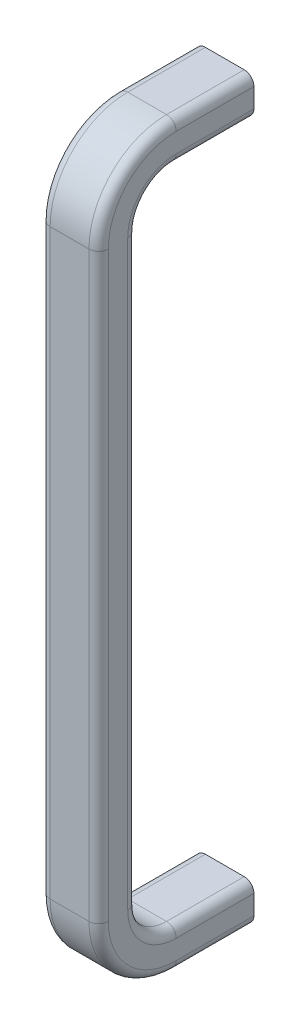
ISO-10303-21;
HEADER;
FILE_DESCRIPTION(('STEP AP214'),'2;1');
FILE_NAME('part.step','',(''),(''),'','','');
FILE_SCHEMA(('AUTOMOTIVE_DESIGN { 1 0 10303 214 1 1 1 1 }'));
ENDSEC;
DATA;
#1=APPLICATION_CONTEXT('core data for automotive mechanical design processes');
#2=APPLICATION_PROTOCOL_DEFINITION('international standard','automotive_design',2000,#1);
#3=PRODUCT_CONTEXT('',#1,'mechanical');
#4=PRODUCT('Part','Part','',(#3));
#5=PRODUCT_RELATED_PRODUCT_CATEGORY('part','',(#4));
#6=PRODUCT_DEFINITION_FORMATION('','',#4);
#7=PRODUCT_DEFINITION_CONTEXT('part definition',#1,'design');
#8=PRODUCT_DEFINITION('design','',#6,#7);
#9=PRODUCT_DEFINITION_SHAPE('','',#8);
#10=(LENGTH_UNIT() NAMED_UNIT(*) SI_UNIT(.MILLI.,.METRE.));
#11=(NAMED_UNIT(*) PLANE_ANGLE_UNIT() SI_UNIT($,.RADIAN.));
#12=(NAMED_UNIT(*) SI_UNIT($,.STERADIAN.) SOLID_ANGLE_UNIT());
#13=UNCERTAINTY_MEASURE_WITH_UNIT(LENGTH_MEASURE(1.E-05),#10,'distance_accuracy_value','');
#14=(GEOMETRIC_REPRESENTATION_CONTEXT(3) GLOBAL_UNCERTAINTY_ASSIGNED_CONTEXT((#13)) GLOBAL_UNIT_ASSIGNED_CONTEXT((#10,
#11,#12)) REPRESENTATION_CONTEXT('',''));
#15=CARTESIAN_POINT('',(0.,0.,0.));
#16=DIRECTION('',(0.,0.,1.));
#17=DIRECTION('',(1.,0.,0.));
#18=AXIS2_PLACEMENT_3D('',#15,#16,#17);
#19=CARTESIAN_POINT('',(0.,-90.,16.9999999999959));
#20=DIRECTION('',(0.,0.,-1.));
#21=DIRECTION('',(-1.,0.,0.));
#22=AXIS2_PLACEMENT_3D('',#19,#20,#21);
#23=CONICAL_SURFACE('',#22,2.0669999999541,1.02974425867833);
#24=CARTESIAN_POINT('',(-5.6843418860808E-11,-90.,18.2419788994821));
#25=VERTEX_POINT('',#24);
#26=VERTEX_LOOP('',#25);
#27=FACE_BOUND('',#26,.T.);
#28=CARTESIAN_POINT('',(0.,-90.,17.));
#29=DIRECTION('',(0.,0.,-1.));
#30=DIRECTION('',(0.,1.,0.));
#31=AXIS2_PLACEMENT_3D('',#28,#29,#30);
#32=CIRCLE('',#31,2.067);
#33=CARTESIAN_POINT('',(0.,-87.933,17.));
#34=VERTEX_POINT('',#33);
#35=EDGE_CURVE('E392',#34,#34,#32,.T.);
#36=ORIENTED_EDGE('',*,*,#35,.T.);
#37=EDGE_LOOP('',(#36));
#38=FACE_BOUND('',#37,.T.);
#39=ADVANCED_FACE('F16',(#27,#38),#23,.F.);
#40=CARTESIAN_POINT('',(0.,90.,16.9999999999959));
#41=DIRECTION('',(0.,0.,-1.));
#42=DIRECTION('',(-1.,0.,0.));
#43=AXIS2_PLACEMENT_3D('',#40,#41,#42);
#44=CONICAL_SURFACE('',#43,2.06699999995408,1.02974425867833);
#45=CARTESIAN_POINT('',(-5.6843418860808E-11,90.,18.2419788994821));
#46=VERTEX_POINT('',#45);
#47=VERTEX_LOOP('',#46);
#48=FACE_BOUND('',#47,.T.);
#49=CARTESIAN_POINT('',(0.,90.,17.0000000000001));
#50=DIRECTION('',(0.,0.,-1.));
#51=DIRECTION('',(0.,1.,0.));
#52=AXIS2_PLACEMENT_3D('',#49,#50,#51);
#53=CIRCLE('',#52,2.067);
#54=CARTESIAN_POINT('',(0.,92.067,17.0000000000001));
#55=VERTEX_POINT('',#54);
#56=EDGE_CURVE('E333',#55,#55,#53,.T.);
#57=ORIENTED_EDGE('',*,*,#56,.T.);
#58=EDGE_LOOP('',(#57));
#59=FACE_BOUND('',#58,.T.);
#60=ADVANCED_FACE('F988',(#48,#59),#44,.F.);
#61=CARTESIAN_POINT('',(0.,-90.,8.5));
#62=DIRECTION('',(0.,0.,-1.));
#63=DIRECTION('',(0.,1.,0.));
#64=AXIS2_PLACEMENT_3D('',#61,#62,#63);
#65=CYLINDRICAL_SURFACE('',#64,2.067);
#66=ORIENTED_EDGE('',*,*,#35,.F.);
#67=EDGE_LOOP('',(#66));
#68=FACE_BOUND('',#67,.T.);
#69=CARTESIAN_POINT('',(0.,-90.,0.));
#70=DIRECTION('',(0.,0.,-1.));
#71=DIRECTION('',(0.,1.,0.));
#72=AXIS2_PLACEMENT_3D('',#69,#70,#71);
#73=CIRCLE('',#72,2.067);
#74=CARTESIAN_POINT('',(0.,-87.933,0.));
#75=VERTEX_POINT('',#74);
#76=EDGE_CURVE('E449',#75,#75,#73,.F.);
#77=ORIENTED_EDGE('',*,*,#76,.F.);
#78=EDGE_LOOP('',(#77));
#79=FACE_BOUND('',#78,.T.);
#80=ADVANCED_FACE('F983',(#68,#79),#65,.F.);
#81=CARTESIAN_POINT('',(-7.5,-85.,20.));
#82=DIRECTION('',(0.,1.,0.));
#83=DIRECTION('',(-1.,0.,0.));
#84=AXIS2_PLACEMENT_3D('',#81,#82,#83);
#85=PLANE('',#84);
#86=DIRECTION('',(0.,0.,1.));
#87=VECTOR('',#86,1.);
#88=CARTESIAN_POINT('',(-4.99999999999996,-85.,10.));
#89=LINE('',#88,#87);
#90=CARTESIAN_POINT('',(-4.99999999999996,-85.,20.));
#91=VERTEX_POINT('',#90);
#92=CARTESIAN_POINT('',(-4.99999999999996,-85.,0.));
#93=VERTEX_POINT('',#92);
#94=EDGE_CURVE('E191',#91,#93,#89,.F.);
#95=ORIENTED_EDGE('',*,*,#94,.F.);
#96=DIRECTION('',(1.,0.,0.));
#97=VECTOR('',#96,1.);
#98=CARTESIAN_POINT('',(-7.50000000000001,-85.,20.));
#99=LINE('',#98,#97);
#100=CARTESIAN_POINT('',(5.,-85.,20.));
#101=VERTEX_POINT('',#100);
#102=EDGE_CURVE('E379',#91,#101,#99,.T.);
#103=ORIENTED_EDGE('',*,*,#102,.T.);
#104=DIRECTION('',(0.,0.,-1.));
#105=VECTOR('',#104,1.);
#106=CARTESIAN_POINT('',(5.,-85.,10.));
#107=LINE('',#106,#105);
#108=CARTESIAN_POINT('',(5.,-85.,0.));
#109=VERTEX_POINT('',#108);
#110=EDGE_CURVE('E395',#109,#101,#107,.F.);
#111=ORIENTED_EDGE('',*,*,#110,.F.);
#112=DIRECTION('',(1.,0.,0.));
#113=VECTOR('',#112,1.);
#114=CARTESIAN_POINT('',(0.,-85.,0.));
#115=LINE('',#114,#113);
#116=EDGE_CURVE('E452',#93,#109,#115,.T.);
#117=ORIENTED_EDGE('',*,*,#116,.F.);
#118=EDGE_LOOP('',(#95,#103,#111,#117));
#119=FACE_BOUND('',#118,.T.);
#120=ADVANCED_FACE('F911',(#119),#85,.T.);
#121=CARTESIAN_POINT('',(-7.50000000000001,-75.,20.));
#122=DIRECTION('',(1.,0.,0.));
#123=DIRECTION('',(0.,0.,-1.));
#124=AXIS2_PLACEMENT_3D('',#121,#122,#123);
#125=CYLINDRICAL_SURFACE('',#124,10.);
#126=ORIENTED_EDGE('',*,*,#102,.F.);
#127=CARTESIAN_POINT('',(-4.99999999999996,-75.,20.));
#128=DIRECTION('',(1.,0.,0.));
#129=DIRECTION('',(0.,0.,-1.));
#130=AXIS2_PLACEMENT_3D('',#127,#128,#129);
#131=CIRCLE('',#130,10.);
#132=CARTESIAN_POINT('',(-4.99999999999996,-75.,30.));
#133=VERTEX_POINT('',#132);
#134=EDGE_CURVE('E263',#133,#91,#131,.T.);
#135=ORIENTED_EDGE('',*,*,#134,.F.);
#136=DIRECTION('',(1.,0.,0.));
#137=VECTOR('',#136,1.);
#138=CARTESIAN_POINT('',(-7.5,-75.,30.));
#139=LINE('',#138,#137);
#140=CARTESIAN_POINT('',(5.,-75.,30.));
#141=VERTEX_POINT('',#140);
#142=EDGE_CURVE('E366',#141,#133,#139,.F.);
#143=ORIENTED_EDGE('',*,*,#142,.F.);
#144=CARTESIAN_POINT('',(5.,-75.,20.));
#145=DIRECTION('',(-1.,0.,0.));
#146=DIRECTION('',(0.,0.,1.));
#147=AXIS2_PLACEMENT_3D('',#144,#145,#146);
#148=CIRCLE('',#147,10.);
#149=EDGE_CURVE('E382',#101,#141,#148,.T.);
#150=ORIENTED_EDGE('',*,*,#149,.F.);
#151=EDGE_LOOP('',(#126,#135,#143,#150));
#152=FACE_BOUND('',#151,.T.);
#153=ADVANCED_FACE('F969',(#152),#125,.F.);
#154=CARTESIAN_POINT('',(-7.5,75.,30.));
#155=DIRECTION('',(0.,0.,-1.));
#156=DIRECTION('',(0.,1.,0.));
#157=AXIS2_PLACEMENT_3D('',#154,#155,#156);
#158=PLANE('',#157);
#159=DIRECTION('',(0.,-1.,0.));
#160=VECTOR('',#159,1.);
#161=CARTESIAN_POINT('',(-5.,85.,30.));
#162=LINE('',#161,#160);
#163=CARTESIAN_POINT('',(-5.,75.,30.));
#164=VERTEX_POINT('',#163);
#165=EDGE_CURVE('E293',#164,#133,#162,.T.);
#166=ORIENTED_EDGE('',*,*,#165,.F.);
#167=DIRECTION('',(1.,0.,0.));
#168=VECTOR('',#167,1.);
#169=CARTESIAN_POINT('',(0.,75.,30.));
#170=LINE('',#169,#168);
#171=CARTESIAN_POINT('',(5.,75.,30.));
#172=VERTEX_POINT('',#171);
#173=EDGE_CURVE('E357',#164,#172,#170,.T.);
#174=ORIENTED_EDGE('',*,*,#173,.T.);
#175=DIRECTION('',(0.,1.,0.));
#176=VECTOR('',#175,1.);
#177=CARTESIAN_POINT('',(5.,80.,30.));
#178=LINE('',#177,#176);
#179=EDGE_CURVE('E371',#141,#172,#178,.T.);
#180=ORIENTED_EDGE('',*,*,#179,.F.);
#181=ORIENTED_EDGE('',*,*,#142,.T.);
#182=EDGE_LOOP('',(#166,#174,#180,#181));
#183=FACE_BOUND('',#182,.T.);
#184=ADVANCED_FACE('F964',(#183),#158,.T.);
#185=CARTESIAN_POINT('',(0.,75.,20.));
#186=DIRECTION('',(1.,0.,0.));
#187=DIRECTION('',(0.,0.,-1.));
#188=AXIS2_PLACEMENT_3D('',#185,#186,#187);
#189=CYLINDRICAL_SURFACE('',#188,10.);
#190=ORIENTED_EDGE('',*,*,#173,.F.);
#191=CARTESIAN_POINT('',(-5.,75.,20.));
#192=DIRECTION('',(1.,0.,0.));
#193=DIRECTION('',(0.,0.,-1.));
#194=AXIS2_PLACEMENT_3D('',#191,#192,#193);
#195=CIRCLE('',#194,10.);
#196=CARTESIAN_POINT('',(-5.,85.,20.));
#197=VERTEX_POINT('',#196);
#198=EDGE_CURVE('E299',#197,#164,#195,.T.);
#199=ORIENTED_EDGE('',*,*,#198,.F.);
#200=DIRECTION('',(1.,0.,0.));
#201=VECTOR('',#200,1.);
#202=CARTESIAN_POINT('',(-7.5,85.,20.));
#203=LINE('',#202,#201);
#204=CARTESIAN_POINT('',(5.,85.,20.));
#205=VERTEX_POINT('',#204);
#206=EDGE_CURVE('E338',#205,#197,#203,.F.);
#207=ORIENTED_EDGE('',*,*,#206,.F.);
#208=CARTESIAN_POINT('',(5.,75.,20.));
#209=DIRECTION('',(-1.,0.,0.));
#210=DIRECTION('',(0.,0.,1.));
#211=AXIS2_PLACEMENT_3D('',#208,#209,#210);
#212=CIRCLE('',#211,10.);
#213=EDGE_CURVE('E356',#172,#205,#212,.T.);
#214=ORIENTED_EDGE('',*,*,#213,.F.);
#215=EDGE_LOOP('',(#190,#199,#207,#214));
#216=FACE_BOUND('',#215,.T.);
#217=ADVANCED_FACE('F956',(#216),#189,.F.);
#218=CARTESIAN_POINT('',(-7.5,85.,0.));
#219=DIRECTION('',(0.,-1.,0.));
#220=DIRECTION('',(1.,0.,0.));
#221=AXIS2_PLACEMENT_3D('',#218,#219,#220);
#222=PLANE('',#221);
#223=DIRECTION('',(0.,0.,1.));
#224=VECTOR('',#223,1.);
#225=CARTESIAN_POINT('',(-5.,85.,0.));
#226=LINE('',#225,#224);
#227=CARTESIAN_POINT('',(-5.,85.,0.));
#228=VERTEX_POINT('',#227);
#229=EDGE_CURVE('E326',#228,#197,#226,.T.);
#230=ORIENTED_EDGE('',*,*,#229,.F.);
#231=DIRECTION('',(1.,0.,0.));
#232=VECTOR('',#231,1.);
#233=CARTESIAN_POINT('',(0.,85.,0.));
#234=LINE('',#233,#232);
#235=CARTESIAN_POINT('',(5.,85.,0.));
#236=VERTEX_POINT('',#235);
#237=EDGE_CURVE('E442',#236,#228,#234,.F.);
#238=ORIENTED_EDGE('',*,*,#237,.F.);
#239=DIRECTION('',(0.,0.,-1.));
#240=VECTOR('',#239,1.);
#241=CARTESIAN_POINT('',(5.,85.,0.));
#242=LINE('',#241,#240);
#243=EDGE_CURVE('E346',#205,#236,#242,.T.);
#244=ORIENTED_EDGE('',*,*,#243,.F.);
#245=ORIENTED_EDGE('',*,*,#206,.T.);
#246=EDGE_LOOP('',(#230,#238,#244,#245));
#247=FACE_BOUND('',#246,.T.);
#248=ADVANCED_FACE('F947',(#247),#222,.T.);
#249=CARTESIAN_POINT('',(0.,90.,8.50000000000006));
#250=DIRECTION('',(0.,0.,-1.));
#251=DIRECTION('',(0.,1.,0.));
#252=AXIS2_PLACEMENT_3D('',#249,#250,#251);
#253=CYLINDRICAL_SURFACE('',#252,2.067);
#254=ORIENTED_EDGE('',*,*,#56,.F.);
#255=EDGE_LOOP('',(#254));
#256=FACE_BOUND('',#255,.T.);
#257=CARTESIAN_POINT('',(0.,90.,0.));
#258=DIRECTION('',(0.,0.,-1.));
#259=DIRECTION('',(0.,1.,0.));
#260=AXIS2_PLACEMENT_3D('',#257,#258,#259);
#261=CIRCLE('',#260,2.067);
#262=CARTESIAN_POINT('',(0.,92.067,0.));
#263=VERTEX_POINT('',#262);
#264=EDGE_CURVE('E427',#263,#263,#261,.F.);
#265=ORIENTED_EDGE('',*,*,#264,.F.);
#266=EDGE_LOOP('',(#265));
#267=FACE_BOUND('',#266,.T.);
#268=ADVANCED_FACE('F945',(#256,#267),#253,.F.);
#269=CARTESIAN_POINT('',(-5.,87.5,0.));
#270=DIRECTION('',(0.,0.,1.));
#271=DIRECTION('',(1.,0.,0.));
#272=AXIS2_PLACEMENT_3D('',#269,#270,#271);
#273=CYLINDRICAL_SURFACE('',#272,2.5);
#274=CARTESIAN_POINT('',(-5.,87.5,20.));
#275=DIRECTION('',(0.,0.,1.));
#276=DIRECTION('',(0.,1.,0.));
#277=AXIS2_PLACEMENT_3D('',#274,#275,#276);
#278=CIRCLE('',#277,2.5);
#279=CARTESIAN_POINT('',(-7.5,87.5,20.));
#280=VERTEX_POINT('',#279);
#281=EDGE_CURVE('E320',#280,#197,#278,.T.);
#282=ORIENTED_EDGE('',*,*,#281,.F.);
#283=DIRECTION('',(0.,0.,1.));
#284=VECTOR('',#283,1.);
#285=CARTESIAN_POINT('',(-7.5,87.5,0.));
#286=LINE('',#285,#284);
#287=CARTESIAN_POINT('',(-7.5,87.5,0.));
#288=VERTEX_POINT('',#287);
#289=EDGE_CURVE('E334',#288,#280,#286,.T.);
#290=ORIENTED_EDGE('',*,*,#289,.F.);
#291=CARTESIAN_POINT('',(-5.,87.5,0.));
#292=DIRECTION('',(0.,0.,1.));
#293=DIRECTION('',(1.,0.,0.));
#294=AXIS2_PLACEMENT_3D('',#291,#292,#293);
#295=CIRCLE('',#294,2.5);
#296=EDGE_CURVE('E437',#228,#288,#295,.F.);
#297=ORIENTED_EDGE('',*,*,#296,.F.);
#298=ORIENTED_EDGE('',*,*,#229,.T.);
#299=EDGE_LOOP('',(#282,#290,#297,#298));
#300=FACE_BOUND('',#299,.T.);
#301=ADVANCED_FACE('F313',(#300),#273,.T.);
#302=CARTESIAN_POINT('',(-5.,75.,20.));
#303=DIRECTION('',(1.,0.,0.));
#304=DIRECTION('',(0.,0.,-1.));
#305=AXIS2_PLACEMENT_3D('',#302,#303,#304);
#306=TOROIDAL_SURFACE('',#305,12.5,2.5);
#307=ORIENTED_EDGE('',*,*,#281,.T.);
#308=ORIENTED_EDGE('',*,*,#198,.T.);
#309=CARTESIAN_POINT('',(-5.,75.,32.5));
#310=DIRECTION('',(0.,-1.,0.));
#311=DIRECTION('',(1.,0.,0.));
#312=AXIS2_PLACEMENT_3D('',#309,#310,#311);
#313=CIRCLE('',#312,2.5);
#314=CARTESIAN_POINT('',(-7.5,75.,32.5));
#315=VERTEX_POINT('',#314);
#316=EDGE_CURVE('E296',#315,#164,#313,.T.);
#317=ORIENTED_EDGE('',*,*,#316,.F.);
#318=CARTESIAN_POINT('',(-7.5,75.,20.));
#319=DIRECTION('',(-1.,0.,0.));
#320=DIRECTION('',(0.,0.,1.));
#321=AXIS2_PLACEMENT_3D('',#318,#319,#320);
#322=CIRCLE('',#321,12.5);
#323=EDGE_CURVE('E648',#280,#315,#322,.F.);
#324=ORIENTED_EDGE('',*,*,#323,.F.);
#325=EDGE_LOOP('',(#307,#308,#317,#324));
#326=FACE_BOUND('',#325,.T.);
#327=ADVANCED_FACE('F307',(#326),#306,.T.);
#328=CARTESIAN_POINT('',(-5.,85.,32.5));
#329=DIRECTION('',(0.,-1.,0.));
#330=DIRECTION('',(1.,0.,0.));
#331=AXIS2_PLACEMENT_3D('',#328,#329,#330);
#332=CYLINDRICAL_SURFACE('',#331,2.5);
#333=ORIENTED_EDGE('',*,*,#316,.T.);
#334=ORIENTED_EDGE('',*,*,#165,.T.);
#335=CARTESIAN_POINT('',(-4.99999999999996,-75.,32.5));
#336=DIRECTION('',(0.,-1.,0.));
#337=DIRECTION('',(0.,0.,1.));
#338=AXIS2_PLACEMENT_3D('',#335,#336,#337);
#339=CIRCLE('',#338,2.5);
#340=CARTESIAN_POINT('',(-7.49999999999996,-75.,32.5));
#341=VERTEX_POINT('',#340);
#342=EDGE_CURVE('E283',#341,#133,#339,.T.);
#343=ORIENTED_EDGE('',*,*,#342,.F.);
#344=DIRECTION('',(0.,-1.,0.));
#345=VECTOR('',#344,1.);
#346=CARTESIAN_POINT('',(-7.5,95.,32.5));
#347=LINE('',#346,#345);
#348=EDGE_CURVE('E684',#315,#341,#347,.T.);
#349=ORIENTED_EDGE('',*,*,#348,.F.);
#350=EDGE_LOOP('',(#333,#334,#343,#349));
#351=FACE_BOUND('',#350,.T.);
#352=ADVANCED_FACE('F280',(#351),#332,.T.);
#353=CARTESIAN_POINT('',(-4.99999999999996,-75.,20.));
#354=DIRECTION('',(1.,0.,0.));
#355=DIRECTION('',(0.,0.,-1.));
#356=AXIS2_PLACEMENT_3D('',#353,#354,#355);
#357=TOROIDAL_SURFACE('',#356,12.5,2.5);
#358=ORIENTED_EDGE('',*,*,#134,.T.);
#359=CARTESIAN_POINT('',(-4.99999999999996,-87.5,20.));
#360=DIRECTION('',(0.,0.,1.));
#361=DIRECTION('',(1.,0.,0.));
#362=AXIS2_PLACEMENT_3D('',#359,#360,#361);
#363=CIRCLE('',#362,2.5);
#364=CARTESIAN_POINT('',(-7.49999999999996,-87.5,20.));
#365=VERTEX_POINT('',#364);
#366=EDGE_CURVE('E259',#365,#91,#363,.F.);
#367=ORIENTED_EDGE('',*,*,#366,.F.);
#368=CARTESIAN_POINT('',(-7.49999999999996,-75.,20.));
#369=DIRECTION('',(-1.,0.,0.));
#370=DIRECTION('',(0.,-1.,0.));
#371=AXIS2_PLACEMENT_3D('',#368,#369,#370);
#372=CIRCLE('',#371,12.5);
#373=EDGE_CURVE('E659',#341,#365,#372,.F.);
#374=ORIENTED_EDGE('',*,*,#373,.F.);
#375=ORIENTED_EDGE('',*,*,#342,.T.);
#376=EDGE_LOOP('',(#358,#367,#374,#375));
#377=FACE_BOUND('',#376,.T.);
#378=ADVANCED_FACE('F271',(#377),#357,.T.);
#379=CARTESIAN_POINT('',(-4.99999999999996,-87.5,10.));
#380=DIRECTION('',(0.,0.,1.));
#381=DIRECTION('',(1.,0.,0.));
#382=AXIS2_PLACEMENT_3D('',#379,#380,#381);
#383=CYLINDRICAL_SURFACE('',#382,2.5);
#384=ORIENTED_EDGE('',*,*,#366,.T.);
#385=ORIENTED_EDGE('',*,*,#94,.T.);
#386=CARTESIAN_POINT('',(-4.99999999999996,-87.5,0.));
#387=DIRECTION('',(0.,0.,1.));
#388=DIRECTION('',(1.,0.,0.));
#389=AXIS2_PLACEMENT_3D('',#386,#387,#388);
#390=CIRCLE('',#389,2.5);
#391=CARTESIAN_POINT('',(-7.49999999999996,-87.5,0.));
#392=VERTEX_POINT('',#391);
#393=EDGE_CURVE('E194',#392,#93,#390,.F.);
#394=ORIENTED_EDGE('',*,*,#393,.F.);
#395=DIRECTION('',(0.,0.,1.));
#396=VECTOR('',#395,1.);
#397=CARTESIAN_POINT('',(-7.49999999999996,-87.5,0.));
#398=LINE('',#397,#396);
#399=EDGE_CURVE('E256',#365,#392,#398,.F.);
#400=ORIENTED_EDGE('',*,*,#399,.F.);
#401=EDGE_LOOP('',(#384,#385,#394,#400));
#402=FACE_BOUND('',#401,.T.);
#403=ADVANCED_FACE('F277',(#402),#383,.T.);
#404=CARTESIAN_POINT('',(-4.99999999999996,-92.5,10.));
#405=DIRECTION('',(0.,0.,1.));
#406=DIRECTION('',(1.,0.,0.));
#407=AXIS2_PLACEMENT_3D('',#404,#405,#406);
#408=CYLINDRICAL_SURFACE('',#407,2.5);
#409=CARTESIAN_POINT('',(-5.,-92.5,20.));
#410=DIRECTION('',(0.,0.,-1.));
#411=DIRECTION('',(0.,-1.,0.));
#412=AXIS2_PLACEMENT_3D('',#409,#410,#411);
#413=CIRCLE('',#412,2.5);
#414=CARTESIAN_POINT('',(-7.49999999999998,-92.5,20.));
#415=VERTEX_POINT('',#414);
#416=CARTESIAN_POINT('',(-4.99999999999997,-95.,20.));
#417=VERTEX_POINT('',#416);
#418=EDGE_CURVE('E218',#415,#417,#413,.F.);
#419=ORIENTED_EDGE('',*,*,#418,.F.);
#420=DIRECTION('',(0.,0.,1.));
#421=VECTOR('',#420,1.);
#422=CARTESIAN_POINT('',(-7.49999999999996,-92.5,0.));
#423=LINE('',#422,#421);
#424=CARTESIAN_POINT('',(-7.49999999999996,-92.5,0.));
#425=VERTEX_POINT('',#424);
#426=EDGE_CURVE('E187',#425,#415,#423,.T.);
#427=ORIENTED_EDGE('',*,*,#426,.F.);
#428=CARTESIAN_POINT('',(-4.99999999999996,-92.5,0.));
#429=DIRECTION('',(0.,0.,1.));
#430=DIRECTION('',(1.,0.,0.));
#431=AXIS2_PLACEMENT_3D('',#428,#429,#430);
#432=CIRCLE('',#431,2.5);
#433=CARTESIAN_POINT('',(-4.99999999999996,-95.,0.));
#434=VERTEX_POINT('',#433);
#435=EDGE_CURVE('E19',#434,#425,#432,.F.);
#436=ORIENTED_EDGE('',*,*,#435,.F.);
#437=DIRECTION('',(0.,0.,-1.));
#438=VECTOR('',#437,1.);
#439=CARTESIAN_POINT('',(-4.99999999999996,-95.,20.));
#440=LINE('',#439,#438);
#441=EDGE_CURVE('E184',#417,#434,#440,.T.);
#442=ORIENTED_EDGE('',*,*,#441,.F.);
#443=EDGE_LOOP('',(#419,#427,#436,#442));
#444=FACE_BOUND('',#443,.T.);
#445=ADVANCED_FACE('F183',(#444),#408,.T.);
#446=CARTESIAN_POINT('',(5.,-92.5,10.));
#447=DIRECTION('',(0.,0.,-1.));
#448=DIRECTION('',(-1.,0.,0.));
#449=AXIS2_PLACEMENT_3D('',#446,#447,#448);
#450=CYLINDRICAL_SURFACE('',#449,2.5);
#451=CARTESIAN_POINT('',(5.,-92.5,20.));
#452=DIRECTION('',(0.,0.,1.));
#453=DIRECTION('',(0.,-1.,0.));
#454=AXIS2_PLACEMENT_3D('',#451,#452,#453);
#455=CIRCLE('',#454,2.5);
#456=CARTESIAN_POINT('',(5.,-95.,20.));
#457=VERTEX_POINT('',#456);
#458=CARTESIAN_POINT('',(7.5,-92.5,20.));
#459=VERTEX_POINT('',#458);
#460=EDGE_CURVE('E578',#457,#459,#455,.T.);
#461=ORIENTED_EDGE('',*,*,#460,.F.);
#462=DIRECTION('',(0.,0.,-1.));
#463=VECTOR('',#462,1.);
#464=CARTESIAN_POINT('',(5.,-95.,20.));
#465=LINE('',#464,#463);
#466=CARTESIAN_POINT('',(5.,-95.,0.));
#467=VERTEX_POINT('',#466);
#468=EDGE_CURVE('E204',#467,#457,#465,.F.);
#469=ORIENTED_EDGE('',*,*,#468,.F.);
#470=CARTESIAN_POINT('',(5.,-92.5,0.));
#471=DIRECTION('',(0.,0.,-1.));
#472=DIRECTION('',(-1.,0.,0.));
#473=AXIS2_PLACEMENT_3D('',#470,#471,#472);
#474=CIRCLE('',#473,2.5);
#475=CARTESIAN_POINT('',(7.5,-92.5,0.));
#476=VERTEX_POINT('',#475);
#477=EDGE_CURVE('E200',#476,#467,#474,.T.);
#478=ORIENTED_EDGE('',*,*,#477,.F.);
#479=DIRECTION('',(0.,0.,-1.));
#480=VECTOR('',#479,1.);
#481=CARTESIAN_POINT('',(7.5,-92.5,0.));
#482=LINE('',#481,#480);
#483=EDGE_CURVE('E466',#459,#476,#482,.T.);
#484=ORIENTED_EDGE('',*,*,#483,.F.);
#485=EDGE_LOOP('',(#461,#469,#478,#484));
#486=FACE_BOUND('',#485,.T.);
#487=ADVANCED_FACE('F920',(#486),#450,.T.);
#488=CARTESIAN_POINT('',(0.,-100.,0.));
#489=DIRECTION('',(0.,0.,-1.));
#490=DIRECTION('',(0.,1.,0.));
#491=AXIS2_PLACEMENT_3D('',#488,#489,#490);
#492=PLANE('',#491);
#493=ORIENTED_EDGE('',*,*,#76,.T.);
#494=EDGE_LOOP('',(#493));
#495=FACE_BOUND('',#494,.T.);
#496=ORIENTED_EDGE('',*,*,#477,.T.);
#497=DIRECTION('',(1.,0.,0.));
#498=VECTOR('',#497,1.);
#499=CARTESIAN_POINT('',(7.5,-95.,0.));
#500=LINE('',#499,#498);
#501=EDGE_CURVE('E198',#434,#467,#500,.T.);
#502=ORIENTED_EDGE('',*,*,#501,.F.);
#503=ORIENTED_EDGE('',*,*,#435,.T.);
#504=DIRECTION('',(0.,-1.,0.));
#505=VECTOR('',#504,1.);
#506=CARTESIAN_POINT('',(-7.5,95.,0.));
#507=LINE('',#506,#505);
#508=EDGE_CURVE('E253',#392,#425,#507,.T.);
#509=ORIENTED_EDGE('',*,*,#508,.F.);
#510=ORIENTED_EDGE('',*,*,#393,.T.);
#511=ORIENTED_EDGE('',*,*,#116,.T.);
#512=CARTESIAN_POINT('',(5.,-87.5,0.));
#513=DIRECTION('',(0.,0.,-1.));
#514=DIRECTION('',(-1.,0.,0.));
#515=AXIS2_PLACEMENT_3D('',#512,#513,#514);
#516=CIRCLE('',#515,2.5);
#517=CARTESIAN_POINT('',(7.5,-87.5,0.));
#518=VERTEX_POINT('',#517);
#519=EDGE_CURVE('E398',#518,#109,#516,.F.);
#520=ORIENTED_EDGE('',*,*,#519,.F.);
#521=DIRECTION('',(0.,1.,0.));
#522=VECTOR('',#521,1.);
#523=CARTESIAN_POINT('',(7.5,85.,0.));
#524=LINE('',#523,#522);
#525=EDGE_CURVE('E464',#476,#518,#524,.T.);
#526=ORIENTED_EDGE('',*,*,#525,.F.);
#527=EDGE_LOOP('',(#496,#502,#503,#509,#510,#511,#520,#526));
#528=FACE_BOUND('',#527,.T.);
#529=ADVANCED_FACE('F197',(#495,#528),#492,.T.);
#530=CARTESIAN_POINT('',(5.,-87.5,10.));
#531=DIRECTION('',(0.,0.,-1.));
#532=DIRECTION('',(-1.,0.,0.));
#533=AXIS2_PLACEMENT_3D('',#530,#531,#532);
#534=CYLINDRICAL_SURFACE('',#533,2.5);
#535=CARTESIAN_POINT('',(5.,-87.5,20.));
#536=DIRECTION('',(0.,0.,1.));
#537=DIRECTION('',(0.,-1.,0.));
#538=AXIS2_PLACEMENT_3D('',#535,#536,#537);
#539=CIRCLE('',#538,2.5);
#540=CARTESIAN_POINT('',(7.5,-87.5,20.));
#541=VERTEX_POINT('',#540);
#542=EDGE_CURVE('E390',#541,#101,#539,.T.);
#543=ORIENTED_EDGE('',*,*,#542,.F.);
#544=DIRECTION('',(0.,0.,-1.));
#545=VECTOR('',#544,1.);
#546=CARTESIAN_POINT('',(7.5,-87.5,0.));
#547=LINE('',#546,#545);
#548=EDGE_CURVE('E469',#518,#541,#547,.F.);
#549=ORIENTED_EDGE('',*,*,#548,.F.);
#550=ORIENTED_EDGE('',*,*,#519,.T.);
#551=ORIENTED_EDGE('',*,*,#110,.T.);
#552=EDGE_LOOP('',(#543,#549,#550,#551));
#553=FACE_BOUND('',#552,.T.);
#554=ADVANCED_FACE('F495',(#553),#534,.T.);
#555=CARTESIAN_POINT('',(5.,-75.,20.));
#556=DIRECTION('',(-1.,0.,0.));
#557=DIRECTION('',(0.,0.,1.));
#558=AXIS2_PLACEMENT_3D('',#555,#556,#557);
#559=TOROIDAL_SURFACE('',#558,12.5,2.5);
#560=ORIENTED_EDGE('',*,*,#149,.T.);
#561=CARTESIAN_POINT('',(5.,-75.,32.5));
#562=DIRECTION('',(0.,1.,0.));
#563=DIRECTION('',(0.,0.,1.));
#564=AXIS2_PLACEMENT_3D('',#561,#562,#563);
#565=CIRCLE('',#564,2.5);
#566=CARTESIAN_POINT('',(7.5,-75.,32.5));
#567=VERTEX_POINT('',#566);
#568=EDGE_CURVE('E374',#567,#141,#565,.T.);
#569=ORIENTED_EDGE('',*,*,#568,.F.);
#570=CARTESIAN_POINT('',(7.5,-75.,20.));
#571=DIRECTION('',(1.,0.,0.));
#572=DIRECTION('',(0.,0.,1.));
#573=AXIS2_PLACEMENT_3D('',#570,#571,#572);
#574=CIRCLE('',#573,12.5);
#575=EDGE_CURVE('E767',#541,#567,#574,.F.);
#576=ORIENTED_EDGE('',*,*,#575,.F.);
#577=ORIENTED_EDGE('',*,*,#542,.T.);
#578=EDGE_LOOP('',(#560,#569,#576,#577));
#579=FACE_BOUND('',#578,.T.);
#580=ADVANCED_FACE('F481',(#579),#559,.T.);
#581=CARTESIAN_POINT('',(5.,80.,32.5));
#582=DIRECTION('',(0.,1.,0.));
#583=DIRECTION('',(0.,0.,1.));
#584=AXIS2_PLACEMENT_3D('',#581,#582,#583);
#585=CYLINDRICAL_SURFACE('',#584,2.5);
#586=ORIENTED_EDGE('',*,*,#568,.T.);
#587=ORIENTED_EDGE('',*,*,#179,.T.);
#588=CARTESIAN_POINT('',(5.,75.,32.5));
#589=DIRECTION('',(0.,1.,0.));
#590=DIRECTION('',(0.,0.,1.));
#591=AXIS2_PLACEMENT_3D('',#588,#589,#590);
#592=CIRCLE('',#591,2.5);
#593=CARTESIAN_POINT('',(7.5,75.,32.5));
#594=VERTEX_POINT('',#593);
#595=EDGE_CURVE('E361',#594,#172,#592,.T.);
#596=ORIENTED_EDGE('',*,*,#595,.F.);
#597=DIRECTION('',(0.,1.,0.));
#598=VECTOR('',#597,1.);
#599=CARTESIAN_POINT('',(7.5,85.,32.5));
#600=LINE('',#599,#598);
#601=EDGE_CURVE('E817',#567,#594,#600,.T.);
#602=ORIENTED_EDGE('',*,*,#601,.F.);
#603=EDGE_LOOP('',(#586,#587,#596,#602));
#604=FACE_BOUND('',#603,.T.);
#605=ADVANCED_FACE('F491',(#604),#585,.T.);
#606=CARTESIAN_POINT('',(5.,75.,20.));
#607=DIRECTION('',(-1.,0.,0.));
#608=DIRECTION('',(0.,0.,1.));
#609=AXIS2_PLACEMENT_3D('',#606,#607,#608);
#610=TOROIDAL_SURFACE('',#609,12.5,2.5);
#611=ORIENTED_EDGE('',*,*,#595,.T.);
#612=ORIENTED_EDGE('',*,*,#213,.T.);
#613=CARTESIAN_POINT('',(5.,87.5,20.));
#614=DIRECTION('',(0.,0.,-1.));
#615=DIRECTION('',(-1.,0.,0.));
#616=AXIS2_PLACEMENT_3D('',#613,#614,#615);
#617=CIRCLE('',#616,2.5);
#618=CARTESIAN_POINT('',(7.5,87.5,20.));
#619=VERTEX_POINT('',#618);
#620=EDGE_CURVE('E351',#619,#205,#617,.T.);
#621=ORIENTED_EDGE('',*,*,#620,.F.);
#622=CARTESIAN_POINT('',(7.5,75.,20.));
#623=DIRECTION('',(1.,0.,0.));
#624=DIRECTION('',(0.,1.,0.));
#625=AXIS2_PLACEMENT_3D('',#622,#623,#624);
#626=CIRCLE('',#625,12.5);
#627=EDGE_CURVE('E780',#594,#619,#626,.F.);
#628=ORIENTED_EDGE('',*,*,#627,.F.);
#629=EDGE_LOOP('',(#611,#612,#621,#628));
#630=FACE_BOUND('',#629,.T.);
#631=ADVANCED_FACE('F513',(#630),#610,.T.);
#632=CARTESIAN_POINT('',(5.,87.5,0.));
#633=DIRECTION('',(0.,0.,-1.));
#634=DIRECTION('',(-1.,0.,0.));
#635=AXIS2_PLACEMENT_3D('',#632,#633,#634);
#636=CYLINDRICAL_SURFACE('',#635,2.5);
#637=ORIENTED_EDGE('',*,*,#620,.T.);
#638=ORIENTED_EDGE('',*,*,#243,.T.);
#639=CARTESIAN_POINT('',(5.,87.5,0.));
#640=DIRECTION('',(0.,0.,-1.));
#641=DIRECTION('',(-1.,0.,0.));
#642=AXIS2_PLACEMENT_3D('',#639,#640,#641);
#643=CIRCLE('',#642,2.5);
#644=CARTESIAN_POINT('',(7.5,87.5,0.));
#645=VERTEX_POINT('',#644);
#646=EDGE_CURVE('E349',#645,#236,#643,.T.);
#647=ORIENTED_EDGE('',*,*,#646,.F.);
#648=DIRECTION('',(0.,0.,-1.));
#649=VECTOR('',#648,1.);
#650=CARTESIAN_POINT('',(7.5,87.5,0.));
#651=LINE('',#650,#649);
#652=EDGE_CURVE('E540',#619,#645,#651,.T.);
#653=ORIENTED_EDGE('',*,*,#652,.F.);
#654=EDGE_LOOP('',(#637,#638,#647,#653));
#655=FACE_BOUND('',#654,.T.);
#656=ADVANCED_FACE('F525',(#655),#636,.T.);
#657=CARTESIAN_POINT('',(5.,92.5,0.));
#658=DIRECTION('',(0.,0.,1.));
#659=DIRECTION('',(1.,0.,0.));
#660=AXIS2_PLACEMENT_3D('',#657,#658,#659);
#661=CYLINDRICAL_SURFACE('',#660,2.5);
#662=CARTESIAN_POINT('',(5.,92.5,0.));
#663=DIRECTION('',(0.,0.,1.));
#664=DIRECTION('',(1.,0.,0.));
#665=AXIS2_PLACEMENT_3D('',#662,#663,#664);
#666=CIRCLE('',#665,2.5);
#667=CARTESIAN_POINT('',(5.,95.,0.));
#668=VERTEX_POINT('',#667);
#669=CARTESIAN_POINT('',(7.5,92.5,0.));
#670=VERTEX_POINT('',#669);
#671=EDGE_CURVE('E433',#668,#670,#666,.F.);
#672=ORIENTED_EDGE('',*,*,#671,.F.);
#673=DIRECTION('',(0.,0.,1.));
#674=VECTOR('',#673,1.);
#675=CARTESIAN_POINT('',(5.,95.,0.));
#676=LINE('',#675,#674);
#677=CARTESIAN_POINT('',(5.,95.,20.));
#678=VERTEX_POINT('',#677);
#679=EDGE_CURVE('E713',#678,#668,#676,.F.);
#680=ORIENTED_EDGE('',*,*,#679,.F.);
#681=CARTESIAN_POINT('',(5.,92.5,20.));
#682=DIRECTION('',(0.,0.,1.));
#683=DIRECTION('',(0.,1.,0.));
#684=AXIS2_PLACEMENT_3D('',#681,#682,#683);
#685=CIRCLE('',#684,2.5);
#686=CARTESIAN_POINT('',(7.5,92.5,20.));
#687=VERTEX_POINT('',#686);
#688=EDGE_CURVE('E725',#687,#678,#685,.T.);
#689=ORIENTED_EDGE('',*,*,#688,.F.);
#690=DIRECTION('',(0.,0.,-1.));
#691=VECTOR('',#690,1.);
#692=CARTESIAN_POINT('',(7.5,92.5,0.));
#693=LINE('',#692,#691);
#694=EDGE_CURVE('E536',#670,#687,#693,.F.);
#695=ORIENTED_EDGE('',*,*,#694,.F.);
#696=EDGE_LOOP('',(#672,#680,#689,#695));
#697=FACE_BOUND('',#696,.T.);
#698=ADVANCED_FACE('F885',(#697),#661,.T.);
#699=CARTESIAN_POINT('',(0.,-100.,0.));
#700=DIRECTION('',(0.,0.,-1.));
#701=DIRECTION('',(0.,1.,0.));
#702=AXIS2_PLACEMENT_3D('',#699,#700,#701);
#703=PLANE('',#702);
#704=ORIENTED_EDGE('',*,*,#264,.T.);
#705=EDGE_LOOP('',(#704));
#706=FACE_BOUND('',#705,.T.);
#707=ORIENTED_EDGE('',*,*,#671,.T.);
#708=DIRECTION('',(0.,1.,0.));
#709=VECTOR('',#708,1.);
#710=CARTESIAN_POINT('',(7.5,85.,0.));
#711=LINE('',#710,#709);
#712=EDGE_CURVE('E535',#645,#670,#711,.T.);
#713=ORIENTED_EDGE('',*,*,#712,.F.);
#714=ORIENTED_EDGE('',*,*,#646,.T.);
#715=ORIENTED_EDGE('',*,*,#237,.T.);
#716=ORIENTED_EDGE('',*,*,#296,.T.);
#717=DIRECTION('',(0.,-1.,0.));
#718=VECTOR('',#717,1.);
#719=CARTESIAN_POINT('',(-7.5,95.,0.));
#720=LINE('',#719,#718);
#721=CARTESIAN_POINT('',(-7.5,92.5,0.));
#722=VERTEX_POINT('',#721);
#723=EDGE_CURVE('E328',#722,#288,#720,.T.);
#724=ORIENTED_EDGE('',*,*,#723,.F.);
#725=CARTESIAN_POINT('',(-5.,92.5,0.));
#726=DIRECTION('',(0.,0.,1.));
#727=DIRECTION('',(1.,0.,0.));
#728=AXIS2_PLACEMENT_3D('',#725,#726,#727);
#729=CIRCLE('',#728,2.5);
#730=CARTESIAN_POINT('',(-5.,95.,0.));
#731=VERTEX_POINT('',#730);
#732=EDGE_CURVE('E426',#731,#722,#729,.T.);
#733=ORIENTED_EDGE('',*,*,#732,.F.);
#734=DIRECTION('',(1.,0.,0.));
#735=VECTOR('',#734,1.);
#736=CARTESIAN_POINT('',(7.5,95.,0.));
#737=LINE('',#736,#735);
#738=EDGE_CURVE('E618',#668,#731,#737,.F.);
#739=ORIENTED_EDGE('',*,*,#738,.F.);
#740=EDGE_LOOP('',(#707,#713,#714,#715,#716,#724,#733,#739));
#741=FACE_BOUND('',#740,.T.);
#742=ADVANCED_FACE('F878',(#706,#741),#703,.T.);
#743=CARTESIAN_POINT('',(-5.,92.5,0.));
#744=DIRECTION('',(0.,0.,1.));
#745=DIRECTION('',(1.,0.,0.));
#746=AXIS2_PLACEMENT_3D('',#743,#744,#745);
#747=CYLINDRICAL_SURFACE('',#746,2.5);
#748=ORIENTED_EDGE('',*,*,#732,.T.);
#749=DIRECTION('',(0.,0.,1.));
#750=VECTOR('',#749,1.);
#751=CARTESIAN_POINT('',(-7.5,92.5,0.));
#752=LINE('',#751,#750);
#753=CARTESIAN_POINT('',(-7.5,92.5,20.));
#754=VERTEX_POINT('',#753);
#755=EDGE_CURVE('E331',#754,#722,#752,.F.);
#756=ORIENTED_EDGE('',*,*,#755,.F.);
#757=CARTESIAN_POINT('',(-5.,92.5,20.));
#758=DIRECTION('',(0.,0.,-1.));
#759=DIRECTION('',(0.,1.,0.));
#760=AXIS2_PLACEMENT_3D('',#757,#758,#759);
#761=CIRCLE('',#760,2.5);
#762=CARTESIAN_POINT('',(-5.,95.,20.));
#763=VERTEX_POINT('',#762);
#764=EDGE_CURVE('E871',#763,#754,#761,.F.);
#765=ORIENTED_EDGE('',*,*,#764,.F.);
#766=DIRECTION('',(0.,0.,1.));
#767=VECTOR('',#766,1.);
#768=CARTESIAN_POINT('',(-5.,95.,0.));
#769=LINE('',#768,#767);
#770=EDGE_CURVE('E614',#731,#763,#769,.T.);
#771=ORIENTED_EDGE('',*,*,#770,.F.);
#772=EDGE_LOOP('',(#748,#756,#765,#771));
#773=FACE_BOUND('',#772,.T.);
#774=ADVANCED_FACE('F867',(#773),#747,.T.);
#775=CARTESIAN_POINT('',(-7.5,95.,0.));
#776=DIRECTION('',(-1.,0.,0.));
#777=DIRECTION('',(0.,-1.,0.));
#778=AXIS2_PLACEMENT_3D('',#775,#776,#777);
#779=PLANE('',#778);
#780=CARTESIAN_POINT('',(-7.5,-75.,20.));
#781=DIRECTION('',(1.,0.,0.));
#782=DIRECTION('',(0.,0.,1.));
#783=AXIS2_PLACEMENT_3D('',#780,#781,#782);
#784=CIRCLE('',#783,17.5);
#785=CARTESIAN_POINT('',(-7.49999999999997,-75.,37.5));
#786=VERTEX_POINT('',#785);
#787=EDGE_CURVE('E215',#786,#415,#784,.T.);
#788=ORIENTED_EDGE('',*,*,#787,.F.);
#789=DIRECTION('',(0.,1.,0.));
#790=VECTOR('',#789,1.);
#791=CARTESIAN_POINT('',(-7.5,85.,37.5));
#792=LINE('',#791,#790);
#793=CARTESIAN_POINT('',(-7.5,75.,37.5));
#794=VERTEX_POINT('',#793);
#795=EDGE_CURVE('E228',#794,#786,#792,.F.);
#796=ORIENTED_EDGE('',*,*,#795,.F.);
#797=CARTESIAN_POINT('',(-7.5,75.,20.));
#798=DIRECTION('',(1.,0.,0.));
#799=DIRECTION('',(0.,1.,0.));
#800=AXIS2_PLACEMENT_3D('',#797,#798,#799);
#801=CIRCLE('',#800,17.5);
#802=EDGE_CURVE('E631',#754,#794,#801,.T.);
#803=ORIENTED_EDGE('',*,*,#802,.F.);
#804=ORIENTED_EDGE('',*,*,#755,.T.);
#805=ORIENTED_EDGE('',*,*,#723,.T.);
#806=ORIENTED_EDGE('',*,*,#289,.T.);
#807=ORIENTED_EDGE('',*,*,#323,.T.);
#808=ORIENTED_EDGE('',*,*,#348,.T.);
#809=ORIENTED_EDGE('',*,*,#373,.T.);
#810=ORIENTED_EDGE('',*,*,#399,.T.);
#811=ORIENTED_EDGE('',*,*,#508,.T.);
#812=ORIENTED_EDGE('',*,*,#426,.T.);
#813=EDGE_LOOP('',(#788,#796,#803,#804,#805,#806,#807,#808,#809,#810,#811,#812));
#814=FACE_BOUND('',#813,.T.);
#815=ADVANCED_FACE('F241',(#814),#779,.T.);
#816=CARTESIAN_POINT('',(-5.,-75.,20.));
#817=DIRECTION('',(1.,0.,0.));
#818=DIRECTION('',(0.,0.,-1.));
#819=AXIS2_PLACEMENT_3D('',#816,#817,#818);
#820=TOROIDAL_SURFACE('',#819,17.5,2.5);
#821=CARTESIAN_POINT('',(-4.99999999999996,-75.,37.5));
#822=DIRECTION('',(0.,1.,0.));
#823=DIRECTION('',(-1.,0.,0.));
#824=AXIS2_PLACEMENT_3D('',#821,#822,#823);
#825=CIRCLE('',#824,2.5);
#826=CARTESIAN_POINT('',(-4.99999999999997,-75.,40.));
#827=VERTEX_POINT('',#826);
#828=EDGE_CURVE('E602',#786,#827,#825,.T.);
#829=ORIENTED_EDGE('',*,*,#828,.F.);
#830=ORIENTED_EDGE('',*,*,#787,.T.);
#831=ORIENTED_EDGE('',*,*,#418,.T.);
#832=CARTESIAN_POINT('',(-4.99999999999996,-75.,20.));
#833=DIRECTION('',(-1.,0.,0.));
#834=DIRECTION('',(0.,0.,1.));
#835=AXIS2_PLACEMENT_3D('',#832,#833,#834);
#836=CIRCLE('',#835,20.);
#837=EDGE_CURVE('E226',#827,#417,#836,.F.);
#838=ORIENTED_EDGE('',*,*,#837,.F.);
#839=EDGE_LOOP('',(#829,#830,#831,#838));
#840=FACE_BOUND('',#839,.T.);
#841=ADVANCED_FACE('F240',(#840),#820,.T.);
#842=CARTESIAN_POINT('',(7.5,-95.,20.));
#843=DIRECTION('',(0.,-1.,0.));
#844=DIRECTION('',(0.,0.,-1.));
#845=AXIS2_PLACEMENT_3D('',#842,#843,#844);
#846=PLANE('',#845);
#847=ORIENTED_EDGE('',*,*,#468,.T.);
#848=DIRECTION('',(-1.,0.,0.));
#849=VECTOR('',#848,1.);
#850=CARTESIAN_POINT('',(7.5,-95.,20.));
#851=LINE('',#850,#849);
#852=EDGE_CURVE('E207',#417,#457,#851,.F.);
#853=ORIENTED_EDGE('',*,*,#852,.F.);
#854=ORIENTED_EDGE('',*,*,#441,.T.);
#855=ORIENTED_EDGE('',*,*,#501,.T.);
#856=EDGE_LOOP('',(#847,#853,#854,#855));
#857=FACE_BOUND('',#856,.T.);
#858=ADVANCED_FACE('F210',(#857),#846,.T.);
#859=CARTESIAN_POINT('',(5.,-75.,20.));
#860=DIRECTION('',(-1.,0.,0.));
#861=DIRECTION('',(0.,0.,1.));
#862=AXIS2_PLACEMENT_3D('',#859,#860,#861);
#863=TOROIDAL_SURFACE('',#862,17.5,2.5);
#864=ORIENTED_EDGE('',*,*,#460,.T.);
#865=CARTESIAN_POINT('',(7.5,-75.,20.));
#866=DIRECTION('',(-1.,0.,0.));
#867=DIRECTION('',(0.,-1.,0.));
#868=AXIS2_PLACEMENT_3D('',#865,#866,#867);
#869=CIRCLE('',#868,17.5);
#870=CARTESIAN_POINT('',(7.5,-75.,37.5));
#871=VERTEX_POINT('',#870);
#872=EDGE_CURVE('E802',#871,#459,#869,.F.);
#873=ORIENTED_EDGE('',*,*,#872,.F.);
#874=CARTESIAN_POINT('',(5.,-75.,37.5));
#875=DIRECTION('',(0.,-1.,0.));
#876=DIRECTION('',(0.,0.,-1.));
#877=AXIS2_PLACEMENT_3D('',#874,#875,#876);
#878=CIRCLE('',#877,2.5);
#879=CARTESIAN_POINT('',(5.,-75.,40.));
#880=VERTEX_POINT('',#879);
#881=EDGE_CURVE('E562',#880,#871,#878,.F.);
#882=ORIENTED_EDGE('',*,*,#881,.F.);
#883=CARTESIAN_POINT('',(5.,-75.,20.));
#884=DIRECTION('',(-1.,0.,0.));
#885=DIRECTION('',(0.,0.,1.));
#886=AXIS2_PLACEMENT_3D('',#883,#884,#885);
#887=CIRCLE('',#886,20.);
#888=EDGE_CURVE('E564',#457,#880,#887,.T.);
#889=ORIENTED_EDGE('',*,*,#888,.F.);
#890=EDGE_LOOP('',(#864,#873,#882,#889));
#891=FACE_BOUND('',#890,.T.);
#892=ADVANCED_FACE('F545',(#891),#863,.T.);
#893=CARTESIAN_POINT('',(7.5,85.,0.));
#894=DIRECTION('',(1.,0.,0.));
#895=DIRECTION('',(0.,0.,-1.));
#896=AXIS2_PLACEMENT_3D('',#893,#894,#895);
#897=PLANE('',#896);
#898=DIRECTION('',(0.,-1.,0.));
#899=VECTOR('',#898,1.);
#900=CARTESIAN_POINT('',(7.5,80.,37.5));
#901=LINE('',#900,#899);
#902=CARTESIAN_POINT('',(7.5,75.,37.5));
#903=VERTEX_POINT('',#902);
#904=EDGE_CURVE('E833',#871,#903,#901,.F.);
#905=ORIENTED_EDGE('',*,*,#904,.F.);
#906=ORIENTED_EDGE('',*,*,#872,.T.);
#907=ORIENTED_EDGE('',*,*,#483,.T.);
#908=ORIENTED_EDGE('',*,*,#525,.T.);
#909=ORIENTED_EDGE('',*,*,#548,.T.);
#910=ORIENTED_EDGE('',*,*,#575,.T.);
#911=ORIENTED_EDGE('',*,*,#601,.T.);
#912=ORIENTED_EDGE('',*,*,#627,.T.);
#913=ORIENTED_EDGE('',*,*,#652,.T.);
#914=ORIENTED_EDGE('',*,*,#712,.T.);
#915=ORIENTED_EDGE('',*,*,#694,.T.);
#916=CARTESIAN_POINT('',(7.5,75.,20.));
#917=DIRECTION('',(-1.,0.,0.));
#918=DIRECTION('',(0.,0.,1.));
#919=AXIS2_PLACEMENT_3D('',#916,#917,#918);
#920=CIRCLE('',#919,17.5);
#921=EDGE_CURVE('E720',#903,#687,#920,.T.);
#922=ORIENTED_EDGE('',*,*,#921,.F.);
#923=EDGE_LOOP('',(#905,#906,#907,#908,#909,#910,#911,#912,#913,#914,#915,#922));
#924=FACE_BOUND('',#923,.T.);
#925=ADVANCED_FACE('F555',(#924),#897,.T.);
#926=CARTESIAN_POINT('',(-5.,75.,20.));
#927=DIRECTION('',(-1.,0.,0.));
#928=DIRECTION('',(0.,0.,1.));
#929=AXIS2_PLACEMENT_3D('',#926,#927,#928);
#930=TOROIDAL_SURFACE('',#929,17.5,2.5);
#931=ORIENTED_EDGE('',*,*,#764,.T.);
#932=ORIENTED_EDGE('',*,*,#802,.T.);
#933=CARTESIAN_POINT('',(-5.,75.,37.5));
#934=DIRECTION('',(0.,1.,0.));
#935=DIRECTION('',(-1.,0.,0.));
#936=AXIS2_PLACEMENT_3D('',#933,#934,#935);
#937=CIRCLE('',#936,2.5);
#938=CARTESIAN_POINT('',(-5.,75.,40.));
#939=VERTEX_POINT('',#938);
#940=EDGE_CURVE('E612',#939,#794,#937,.F.);
#941=ORIENTED_EDGE('',*,*,#940,.F.);
#942=CARTESIAN_POINT('',(-5.,75.,20.));
#943=DIRECTION('',(1.,0.,0.));
#944=DIRECTION('',(0.,0.,-1.));
#945=AXIS2_PLACEMENT_3D('',#942,#943,#944);
#946=CIRCLE('',#945,20.);
#947=EDGE_CURVE('E702',#763,#939,#946,.T.);
#948=ORIENTED_EDGE('',*,*,#947,.F.);
#949=EDGE_LOOP('',(#931,#932,#941,#948));
#950=FACE_BOUND('',#949,.T.);
#951=ADVANCED_FACE('F756',(#950),#930,.T.);
#952=CARTESIAN_POINT('',(5.,75.,20.));
#953=DIRECTION('',(1.,0.,0.));
#954=DIRECTION('',(0.,0.,-1.));
#955=AXIS2_PLACEMENT_3D('',#952,#953,#954);
#956=TOROIDAL_SURFACE('',#955,17.5,2.5);
#957=CARTESIAN_POINT('',(5.,75.,37.5));
#958=DIRECTION('',(0.,-1.,0.));
#959=DIRECTION('',(0.,0.,-1.));
#960=AXIS2_PLACEMENT_3D('',#957,#958,#959);
#961=CIRCLE('',#960,2.5);
#962=CARTESIAN_POINT('',(5.,75.,40.));
#963=VERTEX_POINT('',#962);
#964=EDGE_CURVE('E706',#903,#963,#961,.T.);
#965=ORIENTED_EDGE('',*,*,#964,.F.);
#966=ORIENTED_EDGE('',*,*,#921,.T.);
#967=ORIENTED_EDGE('',*,*,#688,.T.);
#968=CARTESIAN_POINT('',(5.,75.,20.));
#969=DIRECTION('',(1.,0.,0.));
#970=DIRECTION('',(0.,0.,-1.));
#971=AXIS2_PLACEMENT_3D('',#968,#969,#970);
#972=CIRCLE('',#971,20.);
#973=EDGE_CURVE('E34',#963,#678,#972,.F.);
#974=ORIENTED_EDGE('',*,*,#973,.F.);
#975=EDGE_LOOP('',(#965,#966,#967,#974));
#976=FACE_BOUND('',#975,.T.);
#977=ADVANCED_FACE('F743',(#976),#956,.T.);
#978=CARTESIAN_POINT('',(7.5,95.,0.));
#979=DIRECTION('',(0.,1.,0.));
#980=DIRECTION('',(0.,0.,1.));
#981=AXIS2_PLACEMENT_3D('',#978,#979,#980);
#982=PLANE('',#981);
#983=ORIENTED_EDGE('',*,*,#770,.T.);
#984=DIRECTION('',(1.,0.,0.));
#985=VECTOR('',#984,1.);
#986=CARTESIAN_POINT('',(0.,95.,20.));
#987=LINE('',#986,#985);
#988=EDGE_CURVE('E630',#678,#763,#987,.F.);
#989=ORIENTED_EDGE('',*,*,#988,.F.);
#990=ORIENTED_EDGE('',*,*,#679,.T.);
#991=ORIENTED_EDGE('',*,*,#738,.T.);
#992=EDGE_LOOP('',(#983,#989,#990,#991));
#993=FACE_BOUND('',#992,.T.);
#994=ADVANCED_FACE('F752',(#993),#982,.T.);
#995=CARTESIAN_POINT('',(-5.,85.,37.5));
#996=DIRECTION('',(0.,1.,0.));
#997=DIRECTION('',(-1.,0.,0.));
#998=AXIS2_PLACEMENT_3D('',#995,#996,#997);
#999=CYLINDRICAL_SURFACE('',#998,2.5);
#1000=ORIENTED_EDGE('',*,*,#940,.T.);
#1001=ORIENTED_EDGE('',*,*,#795,.T.);
#1002=ORIENTED_EDGE('',*,*,#828,.T.);
#1003=DIRECTION('',(0.,-1.,0.));
#1004=VECTOR('',#1003,1.);
#1005=CARTESIAN_POINT('',(-5.,75.,40.));
#1006=LINE('',#1005,#1004);
#1007=EDGE_CURVE('E580',#939,#827,#1006,.T.);
#1008=ORIENTED_EDGE('',*,*,#1007,.F.);
#1009=EDGE_LOOP('',(#1000,#1001,#1002,#1008));
#1010=FACE_BOUND('',#1009,.T.);
#1011=ADVANCED_FACE('F609',(#1010),#999,.T.);
#1012=CARTESIAN_POINT('',(7.5,-75.,20.));
#1013=DIRECTION('',(-1.,0.,0.));
#1014=DIRECTION('',(0.,0.,1.));
#1015=AXIS2_PLACEMENT_3D('',#1012,#1013,#1014);
#1016=CYLINDRICAL_SURFACE('',#1015,20.);
#1017=ORIENTED_EDGE('',*,*,#888,.T.);
#1018=DIRECTION('',(1.,0.,0.));
#1019=VECTOR('',#1018,1.);
#1020=CARTESIAN_POINT('',(7.5,-75.,40.));
#1021=LINE('',#1020,#1019);
#1022=EDGE_CURVE('E571',#827,#880,#1021,.T.);
#1023=ORIENTED_EDGE('',*,*,#1022,.F.);
#1024=ORIENTED_EDGE('',*,*,#837,.T.);
#1025=ORIENTED_EDGE('',*,*,#852,.T.);
#1026=EDGE_LOOP('',(#1017,#1023,#1024,#1025));
#1027=FACE_BOUND('',#1026,.T.);
#1028=ADVANCED_FACE('F597',(#1027),#1016,.T.);
#1029=CARTESIAN_POINT('',(5.,80.,37.5));
#1030=DIRECTION('',(0.,-1.,0.));
#1031=DIRECTION('',(0.,0.,-1.));
#1032=AXIS2_PLACEMENT_3D('',#1029,#1030,#1031);
#1033=CYLINDRICAL_SURFACE('',#1032,2.5);
#1034=ORIENTED_EDGE('',*,*,#964,.T.);
#1035=DIRECTION('',(0.,-1.,0.));
#1036=VECTOR('',#1035,1.);
#1037=CARTESIAN_POINT('',(5.,75.,40.));
#1038=LINE('',#1037,#1036);
#1039=EDGE_CURVE('E27',#880,#963,#1038,.F.);
#1040=ORIENTED_EDGE('',*,*,#1039,.F.);
#1041=ORIENTED_EDGE('',*,*,#881,.T.);
#1042=ORIENTED_EDGE('',*,*,#904,.T.);
#1043=EDGE_LOOP('',(#1034,#1040,#1041,#1042));
#1044=FACE_BOUND('',#1043,.T.);
#1045=ADVANCED_FACE('F842',(#1044),#1033,.T.);
#1046=CARTESIAN_POINT('',(0.,75.,20.));
#1047=DIRECTION('',(1.,0.,0.));
#1048=DIRECTION('',(0.,0.,-1.));
#1049=AXIS2_PLACEMENT_3D('',#1046,#1047,#1048);
#1050=CYLINDRICAL_SURFACE('',#1049,20.);
#1051=ORIENTED_EDGE('',*,*,#973,.T.);
#1052=ORIENTED_EDGE('',*,*,#988,.T.);
#1053=ORIENTED_EDGE('',*,*,#947,.T.);
#1054=DIRECTION('',(1.,0.,0.));
#1055=VECTOR('',#1054,1.);
#1056=CARTESIAN_POINT('',(7.5,75.,40.));
#1057=LINE('',#1056,#1055);
#1058=EDGE_CURVE('E10',#963,#939,#1057,.F.);
#1059=ORIENTED_EDGE('',*,*,#1058,.F.);
#1060=EDGE_LOOP('',(#1051,#1052,#1053,#1059));
#1061=FACE_BOUND('',#1060,.T.);
#1062=ADVANCED_FACE('F846',(#1061),#1050,.T.);
#1063=CARTESIAN_POINT('',(7.5,75.,40.));
#1064=DIRECTION('',(0.,0.,1.));
#1065=DIRECTION('',(0.,-1.,0.));
#1066=AXIS2_PLACEMENT_3D('',#1063,#1064,#1065);
#1067=PLANE('',#1066);
#1068=ORIENTED_EDGE('',*,*,#1039,.T.);
#1069=ORIENTED_EDGE('',*,*,#1058,.T.);
#1070=ORIENTED_EDGE('',*,*,#1007,.T.);
#1071=ORIENTED_EDGE('',*,*,#1022,.T.);
#1072=EDGE_LOOP('',(#1068,#1069,#1070,#1071));
#1073=FACE_BOUND('',#1072,.T.);
#1074=ADVANCED_FACE('F848',(#1073),#1067,.T.);
#1075=CLOSED_SHELL('',(#39,#60,#80,#120,#153,#184,#217,#248,#268,#301,#327,#352,#378,#403,#445,
#487,#529,#554,#580,#605,#631,#656,#698,#742,#774,#815,#841,#858,#892,#925,#951,#977,#994,#1011,
#1028,#1045,#1062,#1074));
#1076=MANIFOLD_SOLID_BREP('B1',#1075);
#1077=ADVANCED_BREP_SHAPE_REPRESENTATION('',(#18,#1076),#14);
#1078=SHAPE_DEFINITION_REPRESENTATION(#9,#1077);
ENDSEC;
END-ISO-10303-21;
